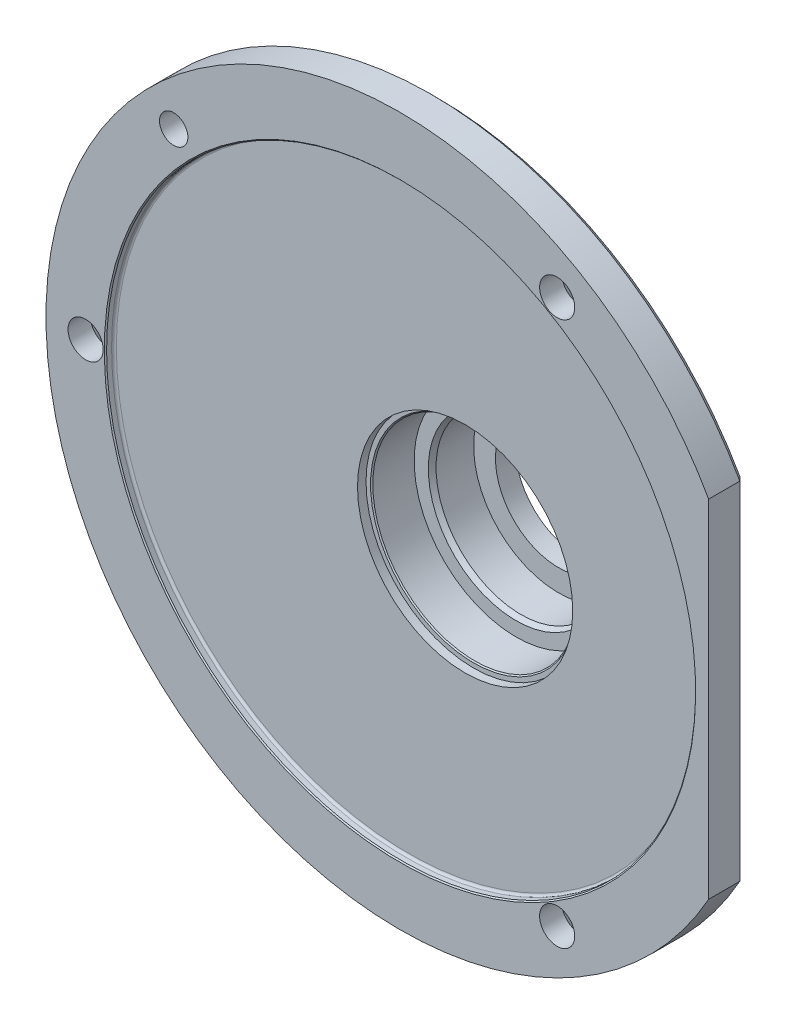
from build123d import *

# Parameters (mm, degrees)
ESQUISSE1_R                               = 62.5
EXTRUSION1_DEPTH                          = 20
ESQUISSE2_R                               = 17.999999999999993
ENL_V_MAT_EXTRU_1_DEPTH                   = 9
ESQUISSE3_R                               = 11.141920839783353
ENL_V_MAT_EXTRU_2_DEPTH                   = 91.62284480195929
ESQUISSE4_R                               = 62.5
ESQUISSE4_R_2                             = 25
ENL_V_MAT_EXTRU_3_DEPTH                   = 15
ESQUISSE5_R                               = 19
ENL_V_MAT_EXTRU_4_DEPTH                   = 1.5
ESQUISSE6_R                               = 62.5
ESQUISSE6_R_2                             = 52
EXTRUSION2_DEPTH                          = 2
ENL_V_MAT_EXTRU_5_REACH                   = 91.652
ENL_V_MAT_EXTRU_6_REACH                   = 91.652
ESQUISSE8_R                               = 3.0999999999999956
CHANFREIN2_SIZE                           = 2.55
R_P_TITION_CIRCULAIRE1_COUNT              = 3
CHANFREIN2_OF_R_P_TITION_CIRCULAIRE1_SIZE = 2.55
ENL_V_MAT_EXTRU_7_DEPTH                   = 135.45910158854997
EXTRUSION3_START                          = 15
EXTRUSION3_DEPTH                          = 15
CONG_7_R                                  = 5.5
ENL_V_MAT_EXTRU_8_DEPTH                   = 10
ENL_V_MAT_EXTRU_9_DEPTH                   = 10
ENL_V_MAT_EXTRU_10_DEPTH                  = 10
CONG_9_R                                  = 5
CONG_10_R                                 = 2
ENL_V_MAT_EXTRU_12_DEPTH                  = 95.85425811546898
ENL_V_MAT_EXTRU_13_DEPTH                  = 104.87769886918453
ENL_V_MAT_EXTRU_14_DEPTH                  = 95.47089498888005
ENL_V_MAT_EXTRU_15_DEPTH                  = 95.47089498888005
ENL_V_MAT_EXTRU_16_DEPTH                  = 95.85425811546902
ENL_V_MAT_EXTRU_17_DEPTH                  = 104.87769886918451
CHANFREIN3_SIZE                           = 1
ESQUISSE15_R                              = 15
ENL_V_MAT_EXTRU_11_DEPTH                  = 7.5
CONG_5_R                                  = 0.42
CHANFREIN4_SIZE                           = 0.2
CHANFREIN5_SIZE                           = 1
ENL_V_MAT_EXTRU_18_DEPTH                  = 0.3
CHANFREIN6_SIZE                           = 0.5
CHANFREIN6_SIZE2                          = 0.8660254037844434
CHANFREIN7_SIZE                           = 0.2


with BuildPart() as part:
    # Esquisse1 → Extrusion1 (new body)
    with BuildSketch(Plane.XY):
        Circle(ESQUISSE1_R)
    extrude(amount=EXTRUSION1_DEPTH)

    # Esquisse2 → Enl_v. mat.-Extru.1 (cut)
    with BuildSketch(Plane.XY.offset(20)):
        with Locations((10, 0)):
            Circle(ESQUISSE2_R)
    extrude(amount=-ENL_V_MAT_EXTRU_1_DEPTH, mode=Mode.SUBTRACT)

    # Esquisse3 → Enl_v. mat.-Extru.2 (cut, through all)
    with BuildSketch(Plane.XY.offset(20)):
        with Locations((10, 0)):
            Circle(ESQUISSE3_R)
    extrude(amount=-ENL_V_MAT_EXTRU_2_DEPTH, mode=Mode.SUBTRACT)

    # Esquisse4 → Enl_v. mat.-Extru.3 (cut)
    with BuildSketch(Plane(origin=(0, 0, 0), x_dir=(-1, 0, 0), z_dir=(0, 0, -1))):
        Circle(ESQUISSE4_R)
        with Locations((-10, 0)):
            Circle(ESQUISSE4_R_2, mode=Mode.SUBTRACT)
    extrude(amount=-ENL_V_MAT_EXTRU_3_DEPTH, mode=Mode.SUBTRACT)

    # Esquisse5 → Enl_v. mat.-Extru.4 (cut)
    with BuildSketch(Plane.XY.offset(20)):
        with Locations((9.999999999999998, 0)):
            Circle(ESQUISSE5_R)
    extrude(amount=-ENL_V_MAT_EXTRU_4_DEPTH, mode=Mode.SUBTRACT)

    # Esquisse6 → Extrusion2 (add)
    with BuildSketch(Plane.XY.offset(20)):
        with Locations(Location((0, 0, 0), (0, 0, 180))):
            Circle(ESQUISSE6_R)
        Circle(ESQUISSE6_R_2, mode=Mode.SUBTRACT)
    extrude(amount=EXTRUSION2_DEPTH)

    # Esquisse7 → Enl_v. mat.-Extru.5 (cut, up to next)
    with BuildSketch(Plane(origin=(0, 0, 15), x_dir=(-1, 0, 0), z_dir=(0, 0, -1)), mode=Mode.PRIVATE) as enl_v_mat_extru_5_sk1:
        with BuildLine():
            Line((-54.49999999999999, 30.594117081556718), (-54.49999999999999, -30.594117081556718))
            ThreePointArc((-54.49999999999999, -30.594117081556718), (-62.5, 7.65e-15), (-54.49999999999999, 30.594117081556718))
        make_face()
    enl_v_mat_extru_5_tool1 = extrude(enl_v_mat_extru_5_sk1.sketch, amount=-ENL_V_MAT_EXTRU_5_REACH, mode=Mode.PRIVATE) & part.part
    add(enl_v_mat_extru_5_tool1.solids().sort_by_distance((57.71823, 0, 15))[0], mode=Mode.SUBTRACT)

    # Esquisse8 → Enl_v. mat.-Extru.6 (cut, up to next)
    with BuildSketch(Plane(origin=(0, 0, 15), x_dir=(-1, 0, 0), z_dir=(0, 0, -1)), mode=Mode.PRIVATE) as enl_v_mat_extru_6_sk1:
        with Locations((55.5, 0)):
            Circle(ESQUISSE8_R)
    enl_v_mat_extru_6_tool1 = extrude(enl_v_mat_extru_6_sk1.sketch, amount=-ENL_V_MAT_EXTRU_6_REACH, mode=Mode.PRIVATE) & part.part
    enl_v_mat_extru_6 = enl_v_mat_extru_6_tool1.solids().sort_by_distance((-55.5, 0, 15))[0]
    add(enl_v_mat_extru_6, mode=Mode.SUBTRACT)

    # Chanfrein2
    chanfrein2_edges = [part.edges().sort_by_distance(p)[0] for p in [
        (-52.400000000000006, 3.8e-16, 15),
    ]]
    chamfer(chanfrein2_edges, length=CHANFREIN2_SIZE)

    # R_p_tition circulaire1: Enl_v. mat.-Extru.6 ×3 about axis
    r_p_tition_circulaire1_axis = Axis((2.74e-15, 7.3e-16, 0), (0, 0, 1))
    for i in range(1, R_P_TITION_CIRCULAIRE1_COUNT):
        add(enl_v_mat_extru_6.rotate(r_p_tition_circulaire1_axis, i * 360 / R_P_TITION_CIRCULAIRE1_COUNT), mode=Mode.SUBTRACT)

    # Chanfrein2 of R_p_tition circulaire1
    chanfrein2_of_r_p_tition_circulaire1_edges = [part.edges().sort_by_distance(p)[0] for p in [
        (26.199999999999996, -45.379731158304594, 15),
        (26.20000000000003, 45.37973115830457, 15),
    ]]
    chamfer(chanfrein2_of_r_p_tition_circulaire1_edges, length=CHANFREIN2_OF_R_P_TITION_CIRCULAIRE1_SIZE)

    # Esquisse9 → Enl_v. mat.-Extru.7 (cut, through all)
    with BuildSketch(Plane(origin=(54.49999999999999, 0, 0), x_dir=(0, 0, -1), z_dir=(1, 0, 0))):
        Polygon((-21.5, 62.5), (-21.499999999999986, -62.5), (-22, -62.5), (-22, 62.5), align=None)
    extrude(amount=-ENL_V_MAT_EXTRU_7_DEPTH, mode=Mode.SUBTRACT)

    # Esquisse10 → Enl_vement de mati_re-R_volution1 (revolve, cut)
    with BuildSketch(Plane(origin=(0, 0, 0), x_dir=(0, 0, -1), z_dir=(0.7071067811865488, 0.7071067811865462, 0)), mode=Mode.PRIVATE) as enl_vement_de_mati_re_r_volution1_sk:
        Polygon((-21.499999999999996, 59.00000000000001), (-9.499999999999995, 59.00000000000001), (-8.056624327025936, 56.5), (-21.499999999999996, 56.5), align=None)
    revolve(enl_vement_de_mati_re_r_volution1_sk.sketch.rotate(Axis((-39.95153313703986, 39.95153313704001, 35.87621797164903), (0, 0, -1)), 135), axis=Axis((-39.95153313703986, 39.95153313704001, 35.87621797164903), (0, 0, -1)), mode=Mode.SUBTRACT)

    # Esquisse11 → Extrusion3 (add)
    with BuildSketch(Plane(origin=(0, 0, 15), x_dir=(-1, 0, 0), z_dir=(0, 0, -1)).offset(EXTRUSION3_START)):
        with BuildLine():
            Line((-20.059462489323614, 41.672568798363), (-13.79533628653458, 24.71022910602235))
            ThreePointArc((-13.79533628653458, 24.71022910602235), (-18.66070074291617, 23.45191383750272), (-23.176101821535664, 21.24594880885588))
            Line((-23.176101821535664, 21.24594880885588), (-29.440228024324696, 38.20828850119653))
            ThreePointArc((-29.440228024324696, 38.20828850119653), (-24.285719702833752, 38.68364437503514), (-20.059462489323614, 41.672568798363))
        make_face()
        with BuildLine():
            Line((14.494897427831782, 4.999999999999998), (46.83974596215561, 5))
            ThreePointArc((46.83974596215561, 5), (45.5, 1.22e-15), (46.83974596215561, -5))
            Line((46.83974596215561, -5), (14.494897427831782, -4.999999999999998))
            ThreePointArc((14.494897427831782, -4.999999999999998), (15, 0), (14.494897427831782, 4.999999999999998))
        make_face()
        with BuildLine():
            Line((-20.059462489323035, -41.67256879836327), (-13.79533628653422, -24.710229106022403))
            ThreePointArc((-13.79533628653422, -24.710229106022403), (-18.660700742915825, -23.451913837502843), (-23.176101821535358, -21.245948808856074))
            Line((-23.176101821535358, -21.245948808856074), (-29.44022802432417, -38.20828850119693))
            ThreePointArc((-29.44022802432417, -38.20828850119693), (-24.28571970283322, -38.68364437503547), (-20.059462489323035, -41.67256879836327))
        make_face()
    extrude(amount=-EXTRUSION3_DEPTH)

    # Cong_7
    cong_7_edges = [part.edges().sort_by_distance(p)[0] for p in [
        (13.79533628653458, 24.71022910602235, 7.5),
        (23.176101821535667, 21.24594880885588, 7.5),
        (-14.494897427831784, -4.999999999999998, 7.5),
        (-14.494897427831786, 4.999999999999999, 7.5),
        (23.17610182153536, -21.245948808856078, 7.5),
        (13.79533628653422, -24.710229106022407, 7.5),
    ]]
    fillet(cong_7_edges, radius=CONG_7_R)

    # Esquisse12 → Enl_v. mat.-Extru.8 (cut)
    with BuildSketch(Plane.XZ.offset(4.999999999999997)):
        Polygon((-46.83974596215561, 0), (-13.570226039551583, 0), (-46.83974596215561, 15), align=None)
    extrude(amount=-ENL_V_MAT_EXTRU_8_DEPTH, mode=Mode.SUBTRACT)

    # Esquisse13 → Enl_v. mat.-Extru.9 (cut)
    with BuildSketch(Plane(origin=(4.109493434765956, 1.5176199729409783, 0), x_dir=(0, 0, 1), z_dir=(-0.9380765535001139, -0.3464280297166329, 0))):
        Polygon((15, -46.04121978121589), (0, -46.04121978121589), (0, -27.034506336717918), align=None)
    extrude(amount=-ENL_V_MAT_EXTRU_9_DEPTH, mode=Mode.SUBTRACT)

    # Esquisse14 → Enl_v. mat.-Extru.10 (cut)
    with BuildSketch(Plane(origin=(13.490258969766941, -4.9819002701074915, 0), x_dir=(0, 0, -1), z_dir=(0.9380765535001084, -0.34642802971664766, 0))):
        Polygon((-15, 46.0412197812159), (0, 46.0412197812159), (0, 27.034506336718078), align=None)
    extrude(amount=-ENL_V_MAT_EXTRU_10_DEPTH, mode=Mode.SUBTRACT)

    # Cong_9
    cong_9_edges = [part.edges().sort_by_distance(p)[0] for p in [
        (27.025399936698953, 31.669286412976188, 15),
        (-32.73769404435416, 4.999999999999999, 15),
        (17.644634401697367, -35.13356671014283, 15),
        (-4.291299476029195, -20.51240500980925, 15),
        (27.025399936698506, -31.669286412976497, 15),
        (35, -1.7457e-13, 15),
        (17.644634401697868, 35.13356671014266, 15),
        (-4.291299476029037, 20.51240500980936, 15),
        (-32.73769404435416, -4.999999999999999, 15),
        (24.4491109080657, -21.83273229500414, 15),
        (24.44911090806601, 21.83273229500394, 15),
        (13.209262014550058, 25.983564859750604, 15),
        (-15.48635128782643, 5.99090172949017, 15),
        (-15.48635128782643, -5.990901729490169, 15),
        (13.209262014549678, -25.98356485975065, 15),
    ]]
    fillet(cong_9_edges, radius=CONG_9_R)

    # Cong_10
    cong_10_edges = [part.edges().sort_by_distance(p)[0] for p in [
        (13.209262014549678, -25.98356485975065, 0),
        (-15.48635128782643, -5.990901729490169, 0),
        (-4.291299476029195, -20.51240500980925, 0),
        (-15.48635128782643, 5.99090172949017, 0),
        (13.209262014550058, 25.983564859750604, 0),
        (24.44911090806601, 21.83273229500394, 0),
        (24.4491109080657, -21.83273229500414, 0),
        (-4.291299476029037, 20.51240500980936, 0),
        (35, -1.7457e-13, 0),
    ]]
    fillet(cong_10_edges, radius=CONG_10_R)

    # Esquisse17 → Enl_v. mat.-Extru.12 (cut, through all)
    with BuildSketch(Plane(origin=(4.109493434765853, -1.5176199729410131, 0), x_dir=(0, 0, -1), z_dir=(0.9380765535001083, -0.3464280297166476, 0))):
        with BuildLine():
            Line((-3.9976001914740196, 32.09992242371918), (-0.00013131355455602, 27.034672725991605))
            add(Edge.make_bspline(
                [(-0.00013131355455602, 27.034672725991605), (-0.00374339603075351, 27.499951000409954), (-0.07910584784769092, 27.95268965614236), (-0.259148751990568, 28.620088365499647), (-0.33100290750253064, 28.841127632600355), (-0.4908104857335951, 29.27309838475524), (-0.5789603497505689, 29.484924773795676), (-1.0507894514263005, 30.528381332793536), (-1.525995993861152, 31.31387379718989), (-2, 32.09992242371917)],
                knots=[0, 0, 0, 0, 0.24999999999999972, 0.24999999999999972, 0.3749999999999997, 0.3749999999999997, 0.4999999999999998, 0.4999999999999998, 1, 1, 1, 1], degree=3))
            Line((-2, 32.09992242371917), (-3.9976001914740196, 32.09992242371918))
        make_face()
    extrude(amount=-ENL_V_MAT_EXTRU_12_DEPTH, mode=Mode.SUBTRACT)


with BuildPart() as enl_v_mat_extru_12_kept_piece:
    # of the separate pieces the step leaves, the one the design keeps (enl_v_mat_extru_12_pieces_kept)
    add(part.part.solids().sort_by_distance((13.475061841, -23.842972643, 0.000131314))[0])

    # Esquisse18 → Enl_v. mat.-Extru.13 (cut, through all)
    with BuildSketch(Plane(origin=(13.490258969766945, -4.98190027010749, 0), x_dir=(0, 0, 1), z_dir=(-0.9380765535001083, 0.3464280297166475, 0))):
        with BuildLine():
            Line((3.997600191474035, 32.099922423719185), (2.0000000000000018, 32.099922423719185))
            add(Edge.make_bspline(
                [(2.0000000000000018, 32.099922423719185), (1.5259959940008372, 31.313873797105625), (1.0507894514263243, 30.52838133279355), (0.5789603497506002, 29.484924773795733), (0.49081048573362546, 29.2730983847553), (0.3310029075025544, 28.84112763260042), (0.25914875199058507, 28.620088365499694), (0.0791058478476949, 27.952689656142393), (0.00374339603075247, 27.499951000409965), (0.00013131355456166, 27.0346727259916)],
                knots=[0, 0, 0, 0, 0.4999999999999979, 0.4999999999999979, 0.624999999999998, 0.624999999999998, 0.749999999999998, 0.749999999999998, 1, 1, 1, 1], degree=3))
            Line((0.00013131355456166, 27.0346727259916), (3.997600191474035, 32.099922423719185))
        make_face()
    extrude(amount=-ENL_V_MAT_EXTRU_13_DEPTH, mode=Mode.SUBTRACT)


with BuildPart() as enl_v_mat_extru_13_kept_piece:
    # of the separate pieces the step leaves, the one the design keeps (enl_v_mat_extru_13_pieces_kept)
    add(enl_v_mat_extru_12_kept_piece.part.solids().sort_by_distance((13.475061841, -23.842972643, 0.000131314))[0])

    # Esquisse19 → Enl_v. mat.-Extru.14 (cut, through all)
    with BuildSketch(Plane.XZ.offset(-4.999999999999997)):
        with BuildLine():
            Line((-18.635642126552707, 2.283809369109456), (-18.635642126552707, 2.0000000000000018))
            add(Edge.make_bspline(
                [(-18.635642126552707, 2.0000000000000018), (-17.849612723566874, 1.526007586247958), (-17.064136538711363, 1.050810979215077), (-16.020705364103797, 0.5789865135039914), (-15.808884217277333, 0.4908371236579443), (-15.376924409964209, 0.3310292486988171), (-15.15589141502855, 0.2591745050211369), (-14.488512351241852, 0.07912709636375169), (-14.035786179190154, 0.00375781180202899), (-13.570519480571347, 0.00013230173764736)],
                knots=[0, 0, 0, 0, 0.49999999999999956, 0.49999999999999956, 0.6249999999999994, 0.6249999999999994, 0.7499999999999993, 0.7499999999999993, 1, 1, 1, 1], degree=3))
            Line((-13.570519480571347, 0.00013230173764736), (-18.635642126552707, 2.283809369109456))
        make_face()
    extrude(amount=-ENL_V_MAT_EXTRU_14_DEPTH, mode=Mode.SUBTRACT)


with BuildPart() as enl_v_mat_extru_14_kept_piece:
    # of the separate pieces the step leaves, the one the design keeps (enl_v_mat_extru_14_pieces_kept)
    add(enl_v_mat_extru_13_kept_piece.part.solids().sort_by_distance((13.475061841, -23.842972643, 0.000131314))[0])

    # Esquisse20 → Enl_v. mat.-Extru.15 (cut, through all)
    with BuildSketch(Plane(origin=(2.6e-16, -4.999999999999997, 0), x_dir=(1, 5e-17, 0), z_dir=(-5e-17, 1, 0))):
        with BuildLine():
            Line((-18.635642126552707, -2.283809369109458), (-13.570519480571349, -0.00013230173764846))
            add(Edge.make_bspline(
                [(-13.570519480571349, -0.00013230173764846), (-14.035786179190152, -0.0037578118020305), (-14.488512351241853, -0.07912709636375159), (-15.15589141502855, -0.25917450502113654), (-15.376924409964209, -0.3310292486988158), (-15.808884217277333, -0.4908371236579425), (-16.020705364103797, -0.5789865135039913), (-17.06413653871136, -1.0508109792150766), (-17.84961272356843, -1.5260075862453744), (-18.635642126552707, -2)],
                knots=[0, 0, 0, 0, 0.25000000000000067, 0.25000000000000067, 0.37500000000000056, 0.37500000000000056, 0.5000000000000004, 0.5000000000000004, 1, 1, 1, 1], degree=3))
            Line((-18.635642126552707, -2), (-18.635642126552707, -2.283809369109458))
        make_face()
    extrude(amount=-ENL_V_MAT_EXTRU_15_DEPTH, mode=Mode.SUBTRACT)


with BuildPart() as enl_v_mat_extru_15_kept_piece:
    # of the separate pieces the step leaves, the one the design keeps (enl_v_mat_extru_15_pieces_kept)
    add(enl_v_mat_extru_14_kept_piece.part.solids().sort_by_distance((13.475061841, -23.842972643, 0.000131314))[0])

    # Esquisse21 → Enl_v. mat.-Extru.16 (cut, through all)
    with BuildSketch(Plane(origin=(4.109493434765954, 1.5176199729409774, 0), x_dir=(0, 0, -1), z_dir=(0.9380765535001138, 0.346428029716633, 0))):
        with BuildLine():
            Line((-3.9976001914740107, -32.099922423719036), (-2.0000000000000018, -32.099922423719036))
            add(Edge.make_bspline(
                [(-2.0000000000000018, -32.099922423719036), (-1.525995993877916, -31.313873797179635), (-1.050789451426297, -30.528381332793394), (-0.5789603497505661, -29.48492477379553), (-0.490810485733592, -29.273098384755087), (-0.331002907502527, -28.84112763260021), (-0.2591487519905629, -28.620088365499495), (-0.07910584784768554, -27.95268965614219), (-0.00374339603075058, -27.499951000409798), (-0.00013131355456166, -27.034672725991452)],
                knots=[0, 0, 0, 0, 0.4999999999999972, 0.4999999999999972, 0.6249999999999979, 0.6249999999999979, 0.7499999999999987, 0.7499999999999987, 1, 1, 1, 1], degree=3))
            Line((-0.00013131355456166, -27.034672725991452), (-3.9976001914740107, -32.099922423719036))
        make_face()
    extrude(amount=-ENL_V_MAT_EXTRU_16_DEPTH, mode=Mode.SUBTRACT)


with BuildPart() as enl_v_mat_extru_16_kept_piece:
    # of the separate pieces the step leaves, the one the design keeps (enl_v_mat_extru_16_pieces_kept)
    add(enl_v_mat_extru_15_kept_piece.part.solids().sort_by_distance((13.504050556, -23.83208985, 0))[0])

    # Esquisse22 → Enl_v. mat.-Extru.17 (cut, through all)
    with BuildSketch(Plane(origin=(13.490258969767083, 4.981900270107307, 0), x_dir=(0, 0, 1), z_dir=(-0.9380765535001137, -0.3464280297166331, 0))):
        with BuildLine():
            Line((3.9976001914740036, -32.099922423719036), (0.00013131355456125, -27.034672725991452))
            add(Edge.make_bspline(
                [(0.00013131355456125, -27.034672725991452), (0.00374339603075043, -27.499951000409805), (0.07910584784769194, -27.952689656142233), (0.2591487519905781, -28.620088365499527), (0.3310029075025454, -28.841127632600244), (0.4908104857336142, -29.273098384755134), (0.578960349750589, -29.48492477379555), (1.0507894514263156, -30.52838133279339), (1.5259959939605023, -31.313873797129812), (2, -32.099922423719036)],
                knots=[0, 0, 0, 0, 0.25000000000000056, 0.25000000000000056, 0.37500000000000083, 0.37500000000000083, 0.5000000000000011, 0.5000000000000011, 1, 1, 1, 1], degree=3))
            Line((2, -32.099922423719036), (3.9976001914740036, -32.099922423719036))
        make_face()
    extrude(amount=-ENL_V_MAT_EXTRU_17_DEPTH, mode=Mode.SUBTRACT)


with BuildPart() as enl_v_mat_extru_17_kept_piece:
    # of the separate pieces the step leaves, the one the design keeps (enl_v_mat_extru_17_pieces_kept)
    add(enl_v_mat_extru_16_kept_piece.part.solids().sort_by_distance((13.504050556, -23.83208985, 0))[0])

    # Chanfrein3
    chanfrein3_edges = [enl_v_mat_extru_17_kept_piece.edges().sort_by_distance(p)[0] for p in [
        (-62.5, -7.11e-15, 15),
    ]]
    chamfer(chanfrein3_edges, length=CHANFREIN3_SIZE)

    # Esquisse15 → Enl_v. mat.-Extru.11 (cut)
    with BuildSketch(Plane.XY.offset(11.000000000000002)):
        with Locations((10, 0)):
            Circle(ESQUISSE15_R)
    extrude(amount=-ENL_V_MAT_EXTRU_11_DEPTH, mode=Mode.SUBTRACT)

    # Cong_5
    cong_5_edges = [enl_v_mat_extru_17_kept_piece.edges().sort_by_distance(p)[0] for p in [
        (-52, -1.672e-14, 20),
    ]]
    fillet(cong_5_edges, radius=CONG_5_R)

    # Chanfrein4
    chanfrein4_edges = [enl_v_mat_extru_17_kept_piece.edges().sort_by_distance(p)[0] for p in [
        (-52, 1.672e-14, 21.499999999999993),
    ]]
    chamfer(chanfrein4_edges, length=CHANFREIN4_SIZE)

    # Chanfrein5
    chanfrein5_edges = [enl_v_mat_extru_17_kept_piece.edges().sort_by_distance(p)[0] for p in [
        (54.49999999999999, -7.11e-15, 15),
    ]]
    chamfer(chanfrein5_edges, length=CHANFREIN5_SIZE)

    # Esquisse23 → Enl_v. mat.-Extru.18 (cut)
    with BuildSketch(Plane(origin=(0, 0, 0), x_dir=(-1, 0, 0), z_dir=(0, 0, -1))):
        with BuildLine():
            Line((2, -12), (9.68275638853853, -3.7671257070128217))
            Line((9.68275638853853, -3.7671257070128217), (5.959751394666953, -5.5))
            ThreePointArc((5.959751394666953, -5.5), (8.702278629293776, 7.68045231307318), (0.9999999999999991, 18.722222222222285))
            Line((0.9999999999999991, 18.722222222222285), (4.500000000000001, 9))
            Line((4.500000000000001, 9), (-4, 13))
            ThreePointArc((-4, 13), (2.885974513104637, 5.281200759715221), (4.023259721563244, -5))
            Line((4.023259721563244, -5), (2.584334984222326, -0.9255977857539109))
            Line((2.584334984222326, -0.9255977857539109), (2, -12))
        make_face()
    extrude(amount=-ENL_V_MAT_EXTRU_18_DEPTH, mode=Mode.SUBTRACT)

    # Chanfrein6
    chanfrein6_edges = [enl_v_mat_extru_17_kept_piece.edges().sort_by_distance(p)[0] for p in [
        (-5, 8.5e-15, 11.000000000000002),
    ]]
    chanfrein6_side = [enl_v_mat_extru_17_kept_piece.faces().sort_by_distance(p)[0] for p in [
        (-7.490883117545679, 2.14e-15, 11),
    ]]
    chamfer(chanfrein6_edges, length=CHANFREIN6_SIZE, length2=CHANFREIN6_SIZE2, reference=chanfrein6_side[0])

    # Chanfrein7
    chanfrein7_edges = [enl_v_mat_extru_17_kept_piece.edges().sort_by_distance(p)[0] for p in [
        (-7.999999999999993, 2.2e-15, 18.5),
    ]]
    chamfer(chanfrein7_edges, length=CHANFREIN7_SIZE)


solid = enl_v_mat_extru_17_kept_piece.part
